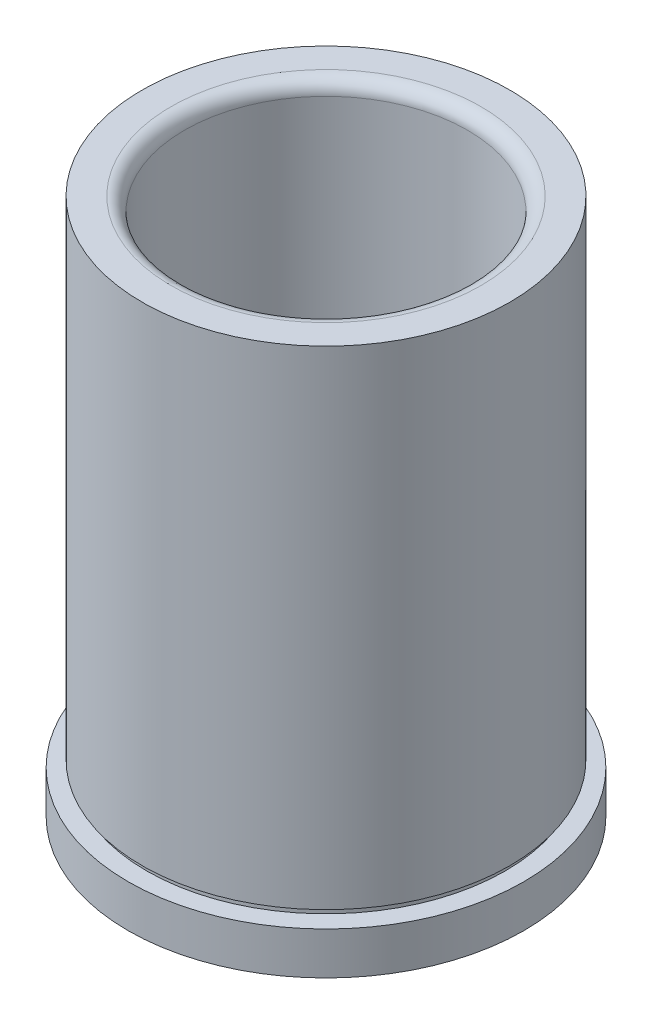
from build123d import *

# Parameters (mm, degrees)
FILLET1_R = 1.524


with BuildPart() as part:
    # Sketch1 → Revolve1 (revolve)
    with BuildSketch(Plane.XY, mode=Mode.PRIVATE) as revolve1_sk:
        Polygon((-15.88135, 76.250690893), (-15.88135, 16.741746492), (-16.697405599, 15.925690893), (-22.225, 15.925690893), (-22.225, 20.688190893), (-20.13585, 20.688190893), (-20.13585, 21.450190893), (-20.64385, 21.450190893), (-20.64385, 76.250690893), align=None)
    revolve(revolve1_sk.sketch.rotate(Axis((0, -1000, 0), (0, 1, 0)), 180), axis=Axis((0, -1000, 0), (0, 1, 0)))

    # Fillet1
    fillet1_edges = [part.edges().sort_by_distance(p)[0] for p in [
        (-15.88135, 76.250690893, 0),
    ]]
    fillet(fillet1_edges, radius=FILLET1_R)


solid = part.part
